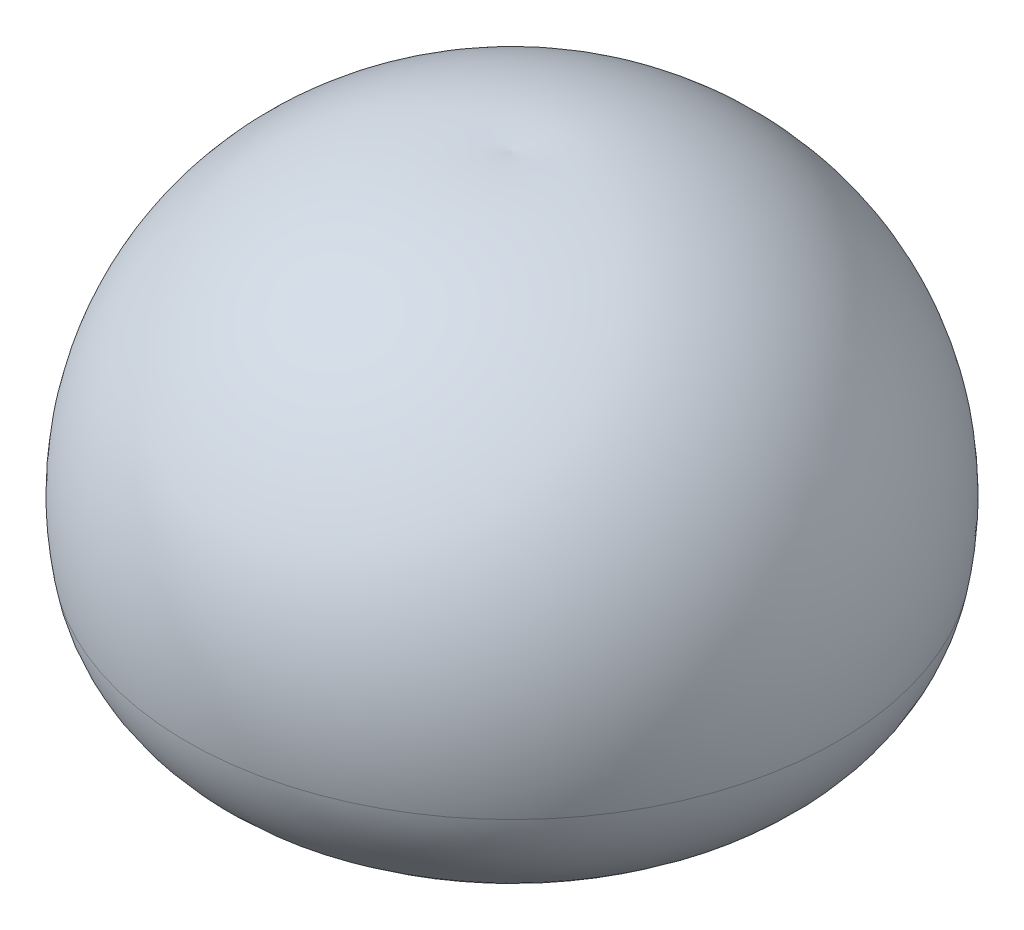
ISO-10303-21;
HEADER;
FILE_DESCRIPTION(('STEP AP214'),'2;1');
FILE_NAME('part.step','',(''),(''),'','','');
FILE_SCHEMA(('AUTOMOTIVE_DESIGN { 1 0 10303 214 1 1 1 1 }'));
ENDSEC;
DATA;
#1=APPLICATION_CONTEXT('core data for automotive mechanical design processes');
#2=APPLICATION_PROTOCOL_DEFINITION('international standard','automotive_design',2000,#1);
#3=PRODUCT_CONTEXT('',#1,'mechanical');
#4=PRODUCT('Part','Part','',(#3));
#5=PRODUCT_RELATED_PRODUCT_CATEGORY('part','',(#4));
#6=PRODUCT_DEFINITION_FORMATION('','',#4);
#7=PRODUCT_DEFINITION_CONTEXT('part definition',#1,'design');
#8=PRODUCT_DEFINITION('design','',#6,#7);
#9=PRODUCT_DEFINITION_SHAPE('','',#8);
#10=(LENGTH_UNIT() NAMED_UNIT(*) SI_UNIT(.MILLI.,.METRE.));
#11=(NAMED_UNIT(*) PLANE_ANGLE_UNIT() SI_UNIT($,.RADIAN.));
#12=(NAMED_UNIT(*) SI_UNIT($,.STERADIAN.) SOLID_ANGLE_UNIT());
#13=UNCERTAINTY_MEASURE_WITH_UNIT(LENGTH_MEASURE(1.E-05),#10,'distance_accuracy_value','');
#14=(GEOMETRIC_REPRESENTATION_CONTEXT(3) GLOBAL_UNCERTAINTY_ASSIGNED_CONTEXT((#13)) GLOBAL_UNIT_ASSIGNED_CONTEXT((#10,
#11,#12)) REPRESENTATION_CONTEXT('',''));
#15=CARTESIAN_POINT('',(0.,0.,0.));
#16=DIRECTION('',(0.,0.,1.));
#17=DIRECTION('',(1.,0.,0.));
#18=AXIS2_PLACEMENT_3D('',#15,#16,#17);
#19=CARTESIAN_POINT('',(-250.,607.,0.));
#20=DIRECTION('',(0.,0.,-1.));
#21=DIRECTION('',(-1.,0.,0.));
#22=AXIS2_PLACEMENT_3D('',#19,#20,#21);
#23=CIRCLE('',#22,2450.71269221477);
#24=TRIMMED_CURVE('',#23,(PARAMETER_VALUE(-1.67298522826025)),
(PARAMETER_VALUE(1.67298522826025)),.T.,.PARAMETER.);
#25=CARTESIAN_POINT('',(0.,607.,0.));
#26=DIRECTION('',(0.,1.,0.));
#27=AXIS1_PLACEMENT('',#25,#26);
#28=SURFACE_OF_REVOLUTION('',#24,#27);
#29=CARTESIAN_POINT('',(0.,3044.92795213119,0.));
#30=VERTEX_POINT('',#29);
#31=VERTEX_LOOP('',#30);
#32=FACE_BOUND('',#31,.T.);
#33=CARTESIAN_POINT('',(0.,181.43820701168,0.));
#34=DIRECTION('',(0.,1.,0.));
#35=DIRECTION('',(-1.,0.,0.));
#36=AXIS2_PLACEMENT_3D('',#33,#34,#35);
#37=CIRCLE('',#36,2663.48085969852);
#38=CARTESIAN_POINT('',(-2663.48085969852,181.43820701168,0.));
#39=VERTEX_POINT('',#38);
#40=EDGE_CURVE('E50',#39,#39,#37,.T.);
#41=ORIENTED_EDGE('',*,*,#40,.T.);
#42=EDGE_LOOP('',(#41));
#43=FACE_BOUND('',#42,.T.);
#44=ADVANCED_FACE('F32',(#32,#43),#28,.T.);
#45=CARTESIAN_POINT('',(902.225071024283,403.831632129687,0.));
#46=DIRECTION('',(0.,0.,-1.));
#47=DIRECTION('',(-1.,0.,0.));
#48=AXIS2_PLACEMENT_3D('',#45,#46,#47);
#49=CIRCLE('',#48,1280.71269221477);
#50=TRIMMED_CURVE('',#49,(PARAMETER_VALUE(-0.789118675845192)),
(PARAMETER_VALUE(0.789118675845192)),.T.,.PARAMETER.);
#51=CARTESIAN_POINT('',(0.,403.831632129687,0.));
#52=DIRECTION('',(0.,1.,0.));
#53=AXIS1_PLACEMENT('',#51,#52);
#54=SURFACE_OF_REVOLUTION('',#50,#53);
#55=CARTESIAN_POINT('',(0.,1119.705290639,0.));
#56=DIRECTION('',(0.,1.,0.));
#57=DIRECTION('',(-1.,0.,0.));
#58=AXIS2_PLACEMENT_3D('',#55,#56,#57);
#59=CIRCLE('',#58,159.730627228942);
#60=CARTESIAN_POINT('',(-159.730627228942,1119.705290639,0.));
#61=VERTEX_POINT('',#60);
#62=EDGE_CURVE('E11',#61,#61,#59,.T.);
#63=ORIENTED_EDGE('',*,*,#62,.F.);
#64=EDGE_LOOP('',(#63));
#65=FACE_BOUND('',#64,.T.);
#66=CARTESIAN_POINT('',(-2.22044604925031E-13,1312.79528443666,0.));
#67=VERTEX_POINT('',#66);
#68=VERTEX_LOOP('',#67);
#69=FACE_BOUND('',#68,.T.);
#70=ADVANCED_FACE('F47',(#65,#69),#54,.F.);
#71=CARTESIAN_POINT('',(0.,607.,0.));
#72=DIRECTION('',(0.,1.,0.));
#73=DIRECTION('',(-1.,0.,0.));
#74=AXIS2_PLACEMENT_3D('',#71,#72,#73);
#75=DEGENERATE_TOROIDAL_SURFACE('',#74,250.,520.591274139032,.T.);
#76=CARTESIAN_POINT('',(0.,94.3406779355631,0.));
#77=DIRECTION('',(0.,1.,0.));
#78=DIRECTION('',(-1.,0.,0.));
#79=AXIS2_PLACEMENT_3D('',#76,#77,#78);
#80=CIRCLE('',#79,159.469926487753);
#81=CARTESIAN_POINT('',(-159.469926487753,94.3406779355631,0.));
#82=VERTEX_POINT('',#81);
#83=EDGE_CURVE('E39',#82,#82,#80,.T.);
#84=ORIENTED_EDGE('',*,*,#83,.F.);
#85=EDGE_LOOP('',(#84));
#86=FACE_BOUND('',#85,.T.);
#87=ORIENTED_EDGE('',*,*,#62,.T.);
#88=EDGE_LOOP('',(#87));
#89=FACE_BOUND('',#88,.T.);
#90=ADVANCED_FACE('F58',(#86,#89),#75,.F.);
#91=CARTESIAN_POINT('',(0.,403.831632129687,0.));
#92=DIRECTION('',(0.,1.,0.));
#93=DIRECTION('',(-1.,0.,0.));
#94=AXIS2_PLACEMENT_3D('',#91,#92,#93);
#95=TOROIDAL_SURFACE('',#94,1402.22507102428,1280.71269221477);
#96=ORIENTED_EDGE('',*,*,#40,.F.);
#97=EDGE_LOOP('',(#96));
#98=FACE_BOUND('',#97,.T.);
#99=ORIENTED_EDGE('',*,*,#83,.T.);
#100=EDGE_LOOP('',(#99));
#101=FACE_BOUND('',#100,.T.);
#102=ADVANCED_FACE('F56',(#98,#101),#95,.T.);
#103=CLOSED_SHELL('',(#44,#70,#90,#102));
#104=MANIFOLD_SOLID_BREP('B2',#103);
#105=ADVANCED_BREP_SHAPE_REPRESENTATION('',(#18,#104),#14);
#106=SHAPE_DEFINITION_REPRESENTATION(#9,#105);
ENDSEC;
END-ISO-10303-21;
